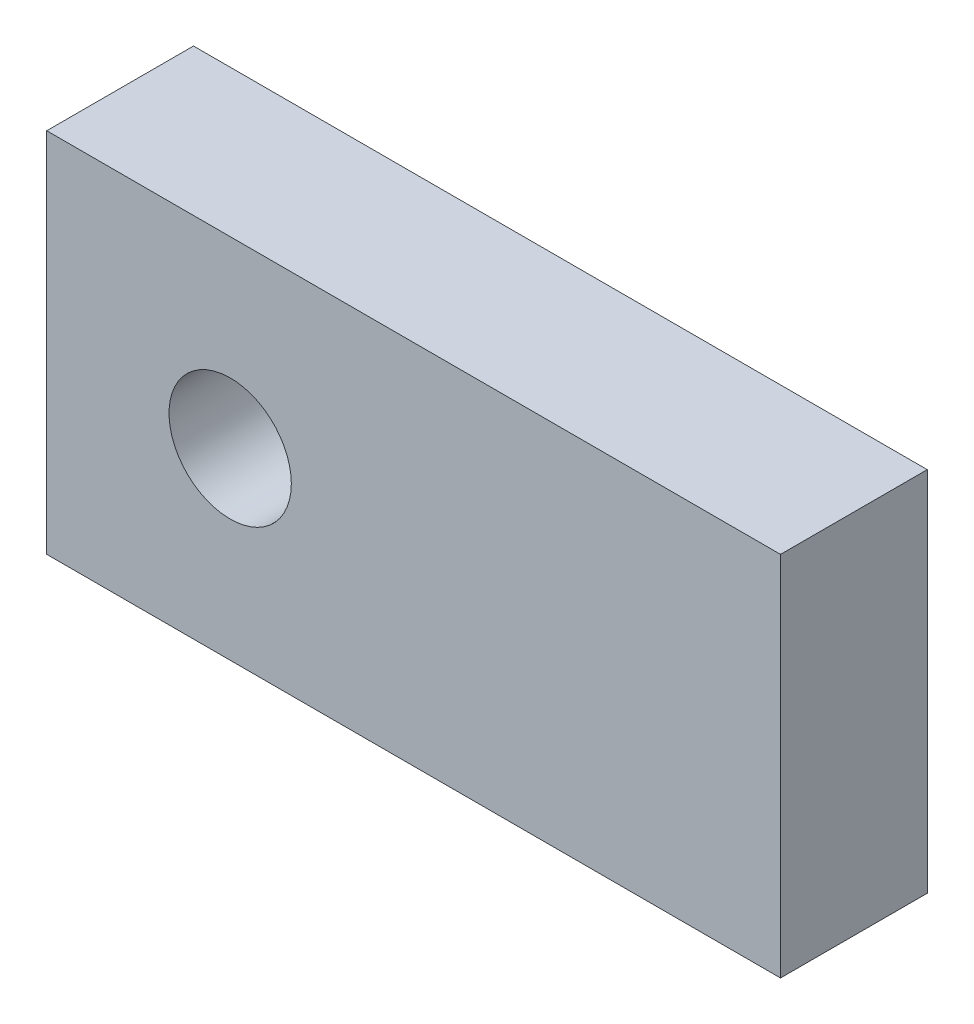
ISO-10303-21;
HEADER;
FILE_DESCRIPTION(('STEP AP214'),'2;1');
FILE_NAME('part.step','',(''),(''),'','','');
FILE_SCHEMA(('AUTOMOTIVE_DESIGN { 1 0 10303 214 1 1 1 1 }'));
ENDSEC;
DATA;
#1=APPLICATION_CONTEXT('core data for automotive mechanical design processes');
#2=APPLICATION_PROTOCOL_DEFINITION('international standard','automotive_design',2000,#1);
#3=PRODUCT_CONTEXT('',#1,'mechanical');
#4=PRODUCT('Part','Part','',(#3));
#5=PRODUCT_RELATED_PRODUCT_CATEGORY('part','',(#4));
#6=PRODUCT_DEFINITION_FORMATION('','',#4);
#7=PRODUCT_DEFINITION_CONTEXT('part definition',#1,'design');
#8=PRODUCT_DEFINITION('design','',#6,#7);
#9=PRODUCT_DEFINITION_SHAPE('','',#8);
#10=(LENGTH_UNIT() NAMED_UNIT(*) SI_UNIT(.MILLI.,.METRE.));
#11=(NAMED_UNIT(*) PLANE_ANGLE_UNIT() SI_UNIT($,.RADIAN.));
#12=(NAMED_UNIT(*) SI_UNIT($,.STERADIAN.) SOLID_ANGLE_UNIT());
#13=UNCERTAINTY_MEASURE_WITH_UNIT(LENGTH_MEASURE(1.E-05),#10,'distance_accuracy_value','');
#14=(GEOMETRIC_REPRESENTATION_CONTEXT(3) GLOBAL_UNCERTAINTY_ASSIGNED_CONTEXT((#13)) GLOBAL_UNIT_ASSIGNED_CONTEXT((#10,
#11,#12)) REPRESENTATION_CONTEXT('',''));
#15=CARTESIAN_POINT('',(0.,0.,0.));
#16=DIRECTION('',(0.,0.,1.));
#17=DIRECTION('',(1.,0.,0.));
#18=AXIS2_PLACEMENT_3D('',#15,#16,#17);
#19=CARTESIAN_POINT('',(45.,15.,0.));
#20=DIRECTION('',(-1.,0.,0.));
#21=DIRECTION('',(0.,-1.,0.));
#22=AXIS2_PLACEMENT_3D('',#19,#20,#21);
#23=PLANE('',#22);
#24=DIRECTION('',(0.,0.,-1.));
#25=VECTOR('',#24,1.);
#26=CARTESIAN_POINT('',(45.,-15.,0.));
#27=LINE('',#26,#25);
#28=CARTESIAN_POINT('',(45.,-15.,12.));
#29=VERTEX_POINT('',#28);
#30=CARTESIAN_POINT('',(45.,-15.,0.));
#31=VERTEX_POINT('',#30);
#32=EDGE_CURVE('E173',#29,#31,#27,.T.);
#33=ORIENTED_EDGE('',*,*,#32,.T.);
#34=DIRECTION('',(0.,-1.,0.));
#35=VECTOR('',#34,1.);
#36=CARTESIAN_POINT('',(45.,15.,0.));
#37=LINE('',#36,#35);
#38=CARTESIAN_POINT('',(45.,15.,0.));
#39=VERTEX_POINT('',#38);
#40=EDGE_CURVE('E9',#39,#31,#37,.T.);
#41=ORIENTED_EDGE('',*,*,#40,.F.);
#42=DIRECTION('',(0.,0.,-1.));
#43=VECTOR('',#42,1.);
#44=CARTESIAN_POINT('',(45.,15.,0.));
#45=LINE('',#44,#43);
#46=CARTESIAN_POINT('',(45.,15.,12.));
#47=VERTEX_POINT('',#46);
#48=EDGE_CURVE('E186',#47,#39,#45,.T.);
#49=ORIENTED_EDGE('',*,*,#48,.F.);
#50=DIRECTION('',(0.,-1.,0.));
#51=VECTOR('',#50,1.);
#52=CARTESIAN_POINT('',(45.,15.,12.));
#53=LINE('',#52,#51);
#54=EDGE_CURVE('E197',#47,#29,#53,.T.);
#55=ORIENTED_EDGE('',*,*,#54,.T.);
#56=EDGE_LOOP('',(#33,#41,#49,#55));
#57=FACE_BOUND('',#56,.T.);
#58=ADVANCED_FACE('F15',(#57),#23,.F.);
#59=CARTESIAN_POINT('',(45.,15.,0.));
#60=DIRECTION('',(0.,0.,1.));
#61=DIRECTION('',(0.,1.,0.));
#62=AXIS2_PLACEMENT_3D('',#59,#60,#61);
#63=PLANE('',#62);
#64=CARTESIAN_POINT('',(7.84744999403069,4.40653249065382,0.));
#65=DIRECTION('',(0.,0.,-1.));
#66=DIRECTION('',(0.,-1.,0.));
#67=AXIS2_PLACEMENT_3D('',#64,#65,#66);
#68=CIRCLE('',#67,2.);
#69=CARTESIAN_POINT('',(6.77285077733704,6.09331538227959,0.));
#70=VERTEX_POINT('',#69);
#71=CARTESIAN_POINT('',(9.59132777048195,5.38576193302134,0.));
#72=VERTEX_POINT('',#71);
#73=EDGE_CURVE('E110',#70,#72,#68,.T.);
#74=ORIENTED_EDGE('',*,*,#73,.F.);
#75=DIRECTION('',(0.843391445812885,0.537299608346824,0.));
#76=VECTOR('',#75,1.);
#77=CARTESIAN_POINT('',(3.2167713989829,3.82784296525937,0.));
#78=LINE('',#77,#76);
#79=CARTESIAN_POINT('',(3.2167713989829,3.82784296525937,0.));
#80=VERTEX_POINT('',#79);
#81=EDGE_CURVE('E132',#80,#70,#78,.T.);
#82=ORIENTED_EDGE('',*,*,#81,.F.);
#83=CARTESIAN_POINT('',(0.,0.,0.));
#84=DIRECTION('',(0.,0.,1.));
#85=DIRECTION('',(1.,0.,0.));
#86=AXIS2_PLACEMENT_3D('',#83,#84,#85);
#87=CIRCLE('',#86,5.);
#88=CARTESIAN_POINT('',(3.2167713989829,-3.82784296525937,0.));
#89=VERTEX_POINT('',#88);
#90=EDGE_CURVE('E169',#80,#89,#87,.T.);
#91=ORIENTED_EDGE('',*,*,#90,.T.);
#92=DIRECTION('',(-0.843391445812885,0.537299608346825,0.));
#93=VECTOR('',#92,1.);
#94=CARTESIAN_POINT('',(3.2167713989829,-3.82784296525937,0.));
#95=LINE('',#94,#93);
#96=CARTESIAN_POINT('',(6.77285077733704,-6.09331538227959,0.));
#97=VERTEX_POINT('',#96);
#98=EDGE_CURVE('E127',#97,#89,#95,.T.);
#99=ORIENTED_EDGE('',*,*,#98,.F.);
#100=CARTESIAN_POINT('',(7.84744999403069,-4.40653249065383,0.));
#101=DIRECTION('',(0.,0.,-1.));
#102=DIRECTION('',(0.,-1.,0.));
#103=AXIS2_PLACEMENT_3D('',#100,#101,#102);
#104=CIRCLE('',#103,2.);
#105=CARTESIAN_POINT('',(9.59132777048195,-5.38576193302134,0.));
#106=VERTEX_POINT('',#105);
#107=EDGE_CURVE('E122',#106,#97,#104,.T.);
#108=ORIENTED_EDGE('',*,*,#107,.F.);
#109=CARTESIAN_POINT('',(0.,0.,0.));
#110=DIRECTION('',(0.,0.,-1.));
#111=DIRECTION('',(0.,-1.,0.));
#112=AXIS2_PLACEMENT_3D('',#109,#110,#111);
#113=CIRCLE('',#112,11.);
#114=EDGE_CURVE('E98',#72,#106,#113,.T.);
#115=ORIENTED_EDGE('',*,*,#114,.F.);
#116=EDGE_LOOP('',(#74,#82,#91,#99,#108,#115));
#117=FACE_BOUND('',#116,.T.);
#118=DIRECTION('',(-1.,0.,0.));
#119=VECTOR('',#118,1.);
#120=CARTESIAN_POINT('',(45.,-15.,0.));
#121=LINE('',#120,#119);
#122=CARTESIAN_POINT('',(-15.,-15.,0.));
#123=VERTEX_POINT('',#122);
#124=EDGE_CURVE('E177',#31,#123,#121,.T.);
#125=ORIENTED_EDGE('',*,*,#124,.T.);
#126=DIRECTION('',(0.,-1.,0.));
#127=VECTOR('',#126,1.);
#128=CARTESIAN_POINT('',(-15.,15.,0.));
#129=LINE('',#128,#127);
#130=CARTESIAN_POINT('',(-15.,15.,0.));
#131=VERTEX_POINT('',#130);
#132=EDGE_CURVE('E23',#131,#123,#129,.T.);
#133=ORIENTED_EDGE('',*,*,#132,.F.);
#134=DIRECTION('',(-1.,0.,0.));
#135=VECTOR('',#134,1.);
#136=CARTESIAN_POINT('',(45.,15.,0.));
#137=LINE('',#136,#135);
#138=EDGE_CURVE('E189',#39,#131,#137,.T.);
#139=ORIENTED_EDGE('',*,*,#138,.F.);
#140=ORIENTED_EDGE('',*,*,#40,.T.);
#141=EDGE_LOOP('',(#125,#133,#139,#140));
#142=FACE_BOUND('',#141,.T.);
#143=ADVANCED_FACE('F118',(#117,#142),#63,.F.);
#144=CARTESIAN_POINT('',(-15.,15.,0.));
#145=DIRECTION('',(1.,0.,0.));
#146=DIRECTION('',(0.,1.,0.));
#147=AXIS2_PLACEMENT_3D('',#144,#145,#146);
#148=PLANE('',#147);
#149=DIRECTION('',(0.,0.,1.));
#150=VECTOR('',#149,1.);
#151=CARTESIAN_POINT('',(-15.,-15.,0.));
#152=LINE('',#151,#150);
#153=CARTESIAN_POINT('',(-15.,-15.,12.));
#154=VERTEX_POINT('',#153);
#155=EDGE_CURVE('E180',#123,#154,#152,.T.);
#156=ORIENTED_EDGE('',*,*,#155,.T.);
#157=DIRECTION('',(0.,-1.,0.));
#158=VECTOR('',#157,1.);
#159=CARTESIAN_POINT('',(-15.,15.,12.));
#160=LINE('',#159,#158);
#161=CARTESIAN_POINT('',(-15.,15.,12.));
#162=VERTEX_POINT('',#161);
#163=EDGE_CURVE('E201',#162,#154,#160,.T.);
#164=ORIENTED_EDGE('',*,*,#163,.F.);
#165=DIRECTION('',(0.,0.,1.));
#166=VECTOR('',#165,1.);
#167=CARTESIAN_POINT('',(-15.,15.,0.));
#168=LINE('',#167,#166);
#169=EDGE_CURVE('E192',#131,#162,#168,.T.);
#170=ORIENTED_EDGE('',*,*,#169,.F.);
#171=ORIENTED_EDGE('',*,*,#132,.T.);
#172=EDGE_LOOP('',(#156,#164,#170,#171));
#173=FACE_BOUND('',#172,.T.);
#174=ADVANCED_FACE('F210',(#173),#148,.F.);
#175=CARTESIAN_POINT('',(-15.,15.,12.));
#176=DIRECTION('',(0.,0.,-1.));
#177=DIRECTION('',(-1.,0.,0.));
#178=AXIS2_PLACEMENT_3D('',#175,#176,#177);
#179=PLANE('',#178);
#180=CARTESIAN_POINT('',(0.,0.,12.));
#181=DIRECTION('',(0.,0.,1.));
#182=DIRECTION('',(1.,0.,0.));
#183=AXIS2_PLACEMENT_3D('',#180,#181,#182);
#184=CIRCLE('',#183,5.);
#185=CARTESIAN_POINT('',(5.,0.,12.));
#186=VERTEX_POINT('',#185);
#187=EDGE_CURVE('E153',#186,#186,#184,.T.);
#188=ORIENTED_EDGE('',*,*,#187,.F.);
#189=EDGE_LOOP('',(#188));
#190=FACE_BOUND('',#189,.T.);
#191=DIRECTION('',(1.,0.,0.));
#192=VECTOR('',#191,1.);
#193=CARTESIAN_POINT('',(-15.,-15.,12.));
#194=LINE('',#193,#192);
#195=EDGE_CURVE('E183',#154,#29,#194,.T.);
#196=ORIENTED_EDGE('',*,*,#195,.T.);
#197=ORIENTED_EDGE('',*,*,#54,.F.);
#198=DIRECTION('',(1.,0.,0.));
#199=VECTOR('',#198,1.);
#200=CARTESIAN_POINT('',(-15.,15.,12.));
#201=LINE('',#200,#199);
#202=EDGE_CURVE('E38',#162,#47,#201,.T.);
#203=ORIENTED_EDGE('',*,*,#202,.F.);
#204=ORIENTED_EDGE('',*,*,#163,.T.);
#205=EDGE_LOOP('',(#196,#197,#203,#204));
#206=FACE_BOUND('',#205,.T.);
#207=ADVANCED_FACE('F217',(#190,#206),#179,.F.);
#208=CARTESIAN_POINT('',(45.,15.,0.));
#209=DIRECTION('',(0.,-1.,0.));
#210=DIRECTION('',(1.,0.,0.));
#211=AXIS2_PLACEMENT_3D('',#208,#209,#210);
#212=PLANE('',#211);
#213=ORIENTED_EDGE('',*,*,#48,.T.);
#214=ORIENTED_EDGE('',*,*,#138,.T.);
#215=ORIENTED_EDGE('',*,*,#169,.T.);
#216=ORIENTED_EDGE('',*,*,#202,.T.);
#217=EDGE_LOOP('',(#213,#214,#215,#216));
#218=FACE_BOUND('',#217,.T.);
#219=ADVANCED_FACE('F221',(#218),#212,.F.);
#220=CARTESIAN_POINT('',(45.,-15.,0.));
#221=DIRECTION('',(0.,-1.,0.));
#222=DIRECTION('',(1.,0.,0.));
#223=AXIS2_PLACEMENT_3D('',#220,#221,#222);
#224=PLANE('',#223);
#225=ORIENTED_EDGE('',*,*,#32,.F.);
#226=ORIENTED_EDGE('',*,*,#195,.F.);
#227=ORIENTED_EDGE('',*,*,#155,.F.);
#228=ORIENTED_EDGE('',*,*,#124,.F.);
#229=EDGE_LOOP('',(#225,#226,#227,#228));
#230=FACE_BOUND('',#229,.T.);
#231=ADVANCED_FACE('F215',(#230),#224,.T.);
#232=CARTESIAN_POINT('',(0.,0.,0.));
#233=DIRECTION('',(0.,0.,1.));
#234=DIRECTION('',(1.,0.,0.));
#235=AXIS2_PLACEMENT_3D('',#232,#233,#234);
#236=CYLINDRICAL_SURFACE('',#235,5.);
#237=ORIENTED_EDGE('',*,*,#90,.F.);
#238=DIRECTION('',(0.,0.,-1.));
#239=VECTOR('',#238,1.);
#240=CARTESIAN_POINT('',(3.2167713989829,3.82784296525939,5.));
#241=LINE('',#240,#239);
#242=CARTESIAN_POINT('',(3.2167713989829,3.82784296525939,5.));
#243=VERTEX_POINT('',#242);
#244=EDGE_CURVE('E154',#243,#80,#241,.T.);
#245=ORIENTED_EDGE('',*,*,#244,.F.);
#246=CARTESIAN_POINT('',(0.,0.,5.));
#247=DIRECTION('',(0.,0.,1.));
#248=DIRECTION('',(0.,-1.,0.));
#249=AXIS2_PLACEMENT_3D('',#246,#247,#248);
#250=CIRCLE('',#249,5.);
#251=CARTESIAN_POINT('',(3.2167713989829,-3.82784296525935,5.));
#252=VERTEX_POINT('',#251);
#253=EDGE_CURVE('E145',#252,#243,#250,.T.);
#254=ORIENTED_EDGE('',*,*,#253,.F.);
#255=DIRECTION('',(0.,0.,-1.));
#256=VECTOR('',#255,1.);
#257=CARTESIAN_POINT('',(3.2167713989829,-3.82784296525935,5.));
#258=LINE('',#257,#256);
#259=EDGE_CURVE('E157',#252,#89,#258,.T.);
#260=ORIENTED_EDGE('',*,*,#259,.T.);
#261=EDGE_LOOP('',(#237,#245,#254,#260));
#262=FACE_BOUND('',#261,.T.);
#263=ORIENTED_EDGE('',*,*,#187,.T.);
#264=EDGE_LOOP('',(#263));
#265=FACE_BOUND('',#264,.T.);
#266=ADVANCED_FACE('F238',(#262,#265),#236,.F.);
#267=CARTESIAN_POINT('',(7.84744999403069,4.40653249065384,5.));
#268=DIRECTION('',(0.,0.,-1.));
#269=DIRECTION('',(0.,-1.,0.));
#270=AXIS2_PLACEMENT_3D('',#267,#268,#269);
#271=CYLINDRICAL_SURFACE('',#270,2.);
#272=ORIENTED_EDGE('',*,*,#73,.T.);
#273=DIRECTION('',(0.,0.,-1.));
#274=VECTOR('',#273,1.);
#275=CARTESIAN_POINT('',(9.59132777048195,5.38576193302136,5.));
#276=LINE('',#275,#274);
#277=CARTESIAN_POINT('',(9.59132777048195,5.38576193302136,5.));
#278=VERTEX_POINT('',#277);
#279=EDGE_CURVE('E94',#278,#72,#276,.T.);
#280=ORIENTED_EDGE('',*,*,#279,.F.);
#281=CARTESIAN_POINT('',(7.84744999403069,4.40653249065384,5.));
#282=DIRECTION('',(0.,0.,-1.));
#283=DIRECTION('',(0.,-1.,0.));
#284=AXIS2_PLACEMENT_3D('',#281,#282,#283);
#285=CIRCLE('',#284,2.);
#286=CARTESIAN_POINT('',(6.77285077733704,6.09331538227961,5.));
#287=VERTEX_POINT('',#286);
#288=EDGE_CURVE('E135',#287,#278,#285,.T.);
#289=ORIENTED_EDGE('',*,*,#288,.F.);
#290=DIRECTION('',(0.,0.,-1.));
#291=VECTOR('',#290,1.);
#292=CARTESIAN_POINT('',(6.77285077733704,6.09331538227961,5.));
#293=LINE('',#292,#291);
#294=EDGE_CURVE('E112',#287,#70,#293,.T.);
#295=ORIENTED_EDGE('',*,*,#294,.T.);
#296=EDGE_LOOP('',(#272,#280,#289,#295));
#297=FACE_BOUND('',#296,.T.);
#298=ADVANCED_FACE('F111',(#297),#271,.F.);
#299=CARTESIAN_POINT('',(3.2167713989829,3.82784296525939,5.));
#300=DIRECTION('',(-0.537299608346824,0.843391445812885,0.));
#301=DIRECTION('',(-0.843391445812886,-0.537299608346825,0.));
#302=AXIS2_PLACEMENT_3D('',#299,#300,#301);
#303=PLANE('',#302);
#304=ORIENTED_EDGE('',*,*,#81,.T.);
#305=ORIENTED_EDGE('',*,*,#294,.F.);
#306=DIRECTION('',(0.843391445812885,0.537299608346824,0.));
#307=VECTOR('',#306,1.);
#308=CARTESIAN_POINT('',(3.2167713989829,3.82784296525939,5.));
#309=LINE('',#308,#307);
#310=EDGE_CURVE('E107',#243,#287,#309,.T.);
#311=ORIENTED_EDGE('',*,*,#310,.F.);
#312=ORIENTED_EDGE('',*,*,#244,.T.);
#313=EDGE_LOOP('',(#304,#305,#311,#312));
#314=FACE_BOUND('',#313,.T.);
#315=ADVANCED_FACE('F244',(#314),#303,.F.);
#316=CARTESIAN_POINT('',(3.2167713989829,-3.82784296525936,5.));
#317=DIRECTION('',(-0.537299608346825,-0.843391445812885,0.));
#318=DIRECTION('',(0.843391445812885,-0.537299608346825,0.));
#319=AXIS2_PLACEMENT_3D('',#316,#317,#318);
#320=PLANE('',#319);
#321=ORIENTED_EDGE('',*,*,#98,.T.);
#322=ORIENTED_EDGE('',*,*,#259,.F.);
#323=DIRECTION('',(-0.843391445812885,0.537299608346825,0.));
#324=VECTOR('',#323,1.);
#325=CARTESIAN_POINT('',(3.2167713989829,-3.82784296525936,5.));
#326=LINE('',#325,#324);
#327=CARTESIAN_POINT('',(6.77285077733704,-6.09331538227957,5.));
#328=VERTEX_POINT('',#327);
#329=EDGE_CURVE('E30',#328,#252,#326,.T.);
#330=ORIENTED_EDGE('',*,*,#329,.F.);
#331=DIRECTION('',(0.,0.,-1.));
#332=VECTOR('',#331,1.);
#333=CARTESIAN_POINT('',(6.77285077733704,-6.09331538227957,5.));
#334=LINE('',#333,#332);
#335=EDGE_CURVE('E161',#328,#97,#334,.T.);
#336=ORIENTED_EDGE('',*,*,#335,.T.);
#337=EDGE_LOOP('',(#321,#322,#330,#336));
#338=FACE_BOUND('',#337,.T.);
#339=ADVANCED_FACE('F251',(#338),#320,.F.);
#340=CARTESIAN_POINT('',(7.84744999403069,-4.40653249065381,5.));
#341=DIRECTION('',(0.,0.,-1.));
#342=DIRECTION('',(0.,-1.,0.));
#343=AXIS2_PLACEMENT_3D('',#340,#341,#342);
#344=CYLINDRICAL_SURFACE('',#343,2.);
#345=ORIENTED_EDGE('',*,*,#107,.T.);
#346=ORIENTED_EDGE('',*,*,#335,.F.);
#347=CARTESIAN_POINT('',(7.84744999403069,-4.40653249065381,5.));
#348=DIRECTION('',(0.,0.,-1.));
#349=DIRECTION('',(0.,-1.,0.));
#350=AXIS2_PLACEMENT_3D('',#347,#348,#349);
#351=CIRCLE('',#350,2.);
#352=CARTESIAN_POINT('',(9.59132777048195,-5.38576193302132,5.));
#353=VERTEX_POINT('',#352);
#354=EDGE_CURVE('E140',#353,#328,#351,.T.);
#355=ORIENTED_EDGE('',*,*,#354,.F.);
#356=DIRECTION('',(0.,0.,-1.));
#357=VECTOR('',#356,1.);
#358=CARTESIAN_POINT('',(9.59132777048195,-5.38576193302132,5.));
#359=LINE('',#358,#357);
#360=EDGE_CURVE('E106',#353,#106,#359,.T.);
#361=ORIENTED_EDGE('',*,*,#360,.T.);
#362=EDGE_LOOP('',(#345,#346,#355,#361));
#363=FACE_BOUND('',#362,.T.);
#364=ADVANCED_FACE('F248',(#363),#344,.F.);
#365=CARTESIAN_POINT('',(0.,0.,5.));
#366=DIRECTION('',(0.,0.,-1.));
#367=DIRECTION('',(0.,-1.,0.));
#368=AXIS2_PLACEMENT_3D('',#365,#366,#367);
#369=CYLINDRICAL_SURFACE('',#368,11.);
#370=ORIENTED_EDGE('',*,*,#114,.T.);
#371=ORIENTED_EDGE('',*,*,#360,.F.);
#372=CARTESIAN_POINT('',(0.,0.,5.));
#373=DIRECTION('',(0.,0.,-1.));
#374=DIRECTION('',(0.,-1.,0.));
#375=AXIS2_PLACEMENT_3D('',#372,#373,#374);
#376=CIRCLE('',#375,11.);
#377=EDGE_CURVE('E101',#278,#353,#376,.T.);
#378=ORIENTED_EDGE('',*,*,#377,.F.);
#379=ORIENTED_EDGE('',*,*,#279,.T.);
#380=EDGE_LOOP('',(#370,#371,#378,#379));
#381=FACE_BOUND('',#380,.T.);
#382=ADVANCED_FACE('F96',(#381),#369,.F.);
#383=CARTESIAN_POINT('',(7.84744999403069,4.40653249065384,5.));
#384=DIRECTION('',(0.,0.,-1.));
#385=DIRECTION('',(0.,-1.,0.));
#386=AXIS2_PLACEMENT_3D('',#383,#384,#385);
#387=PLANE('',#386);
#388=ORIENTED_EDGE('',*,*,#288,.T.);
#389=ORIENTED_EDGE('',*,*,#377,.T.);
#390=ORIENTED_EDGE('',*,*,#354,.T.);
#391=ORIENTED_EDGE('',*,*,#329,.T.);
#392=ORIENTED_EDGE('',*,*,#253,.T.);
#393=ORIENTED_EDGE('',*,*,#310,.T.);
#394=EDGE_LOOP('',(#388,#389,#390,#391,#392,#393));
#395=FACE_BOUND('',#394,.T.);
#396=ADVANCED_FACE('F247',(#395),#387,.T.);
#397=CLOSED_SHELL('',(#58,#143,#174,#207,#219,#231,#266,#298,#315,#339,#364,#382,#396));
#398=MANIFOLD_SOLID_BREP('B1',#397);
#399=ADVANCED_BREP_SHAPE_REPRESENTATION('',(#18,#398),#14);
#400=SHAPE_DEFINITION_REPRESENTATION(#9,#399);
ENDSEC;
END-ISO-10303-21;
